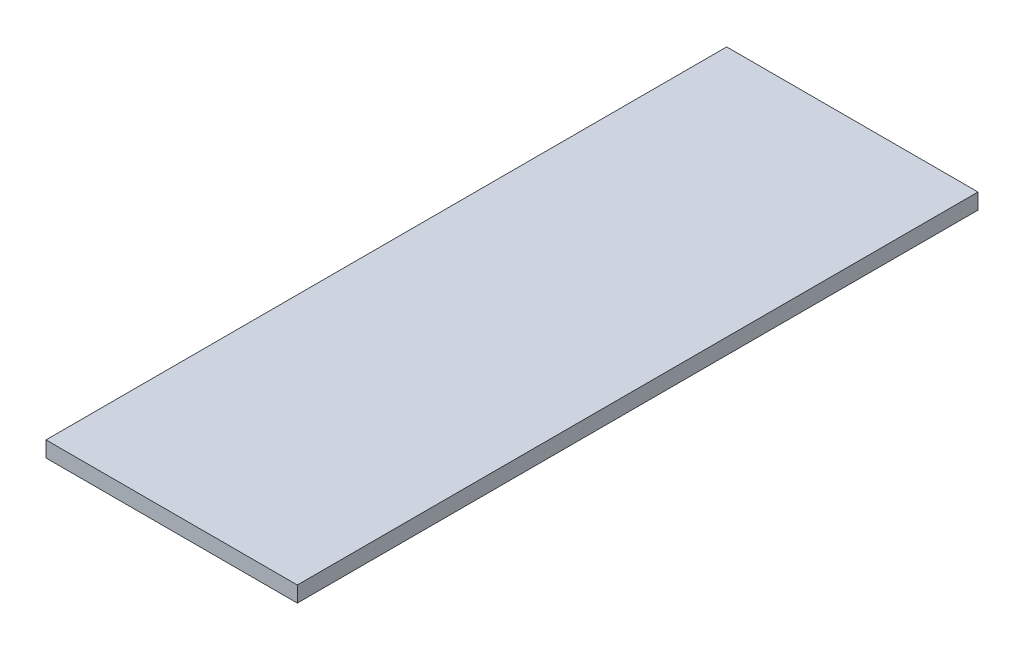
from build123d import *

# Parameters (mm, degrees)
BOSS_EXTRU_1_DEPTH      = 10
BOSS_EXTRU_1_DEPTH_BACK = 120
ESQUISSE1_W             = 48
ESQUISSE1_H             = 3


with BuildPart() as part:
    # Esquisse1 → Boss.-Extru.1 (new, two sides: drawn at the far end of the back side and taken through both)
    with BuildSketch(Plane.XY.offset(-BOSS_EXTRU_1_DEPTH_BACK)):
        with Locations((0, 93.5)):
            Rectangle(ESQUISSE1_W, ESQUISSE1_H)
    extrude(amount=BOSS_EXTRU_1_DEPTH + BOSS_EXTRU_1_DEPTH_BACK)


solid = part.part
